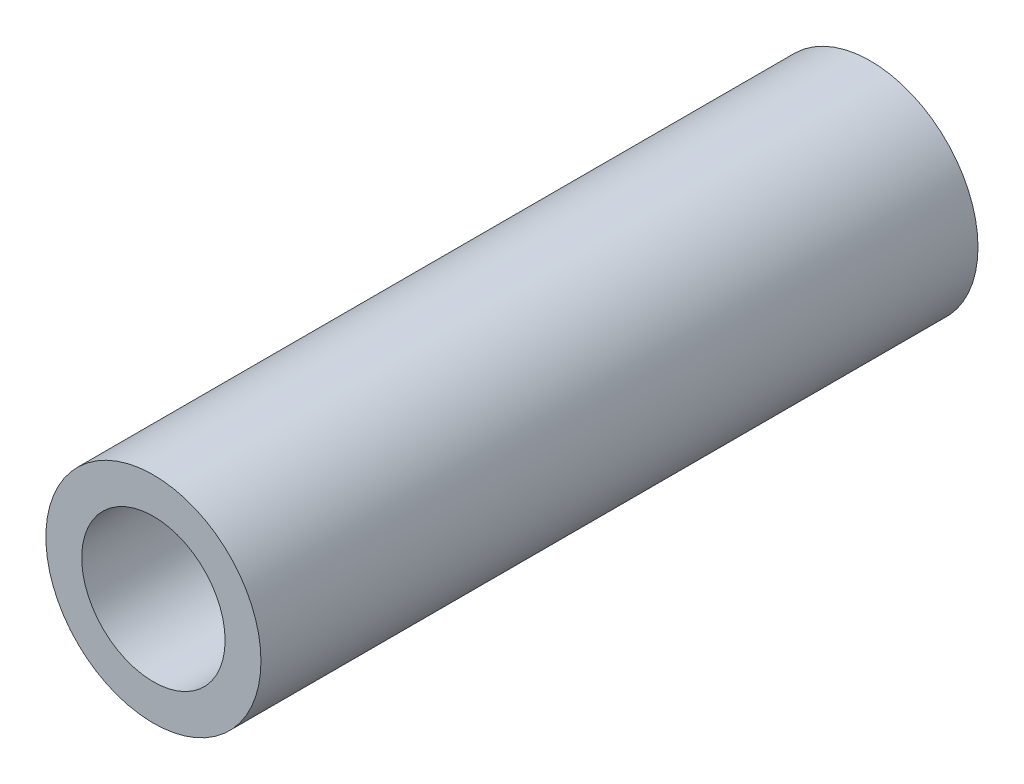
from build123d import *

# Parameters (mm, degrees)
SZKIC1_R                    = 7.5
SZKIC1_R_2                  = 5
DODANIE_WYCI_GNI_CIE1_DEPTH = 50


with BuildPart() as part:
    # Szkic1 → Dodanie-wyci_gni_cie1 (new body)
    with BuildSketch(Plane.XY):
        Circle(SZKIC1_R)
        Circle(SZKIC1_R_2, mode=Mode.SUBTRACT)
    extrude(amount=DODANIE_WYCI_GNI_CIE1_DEPTH)


solid = part.part
